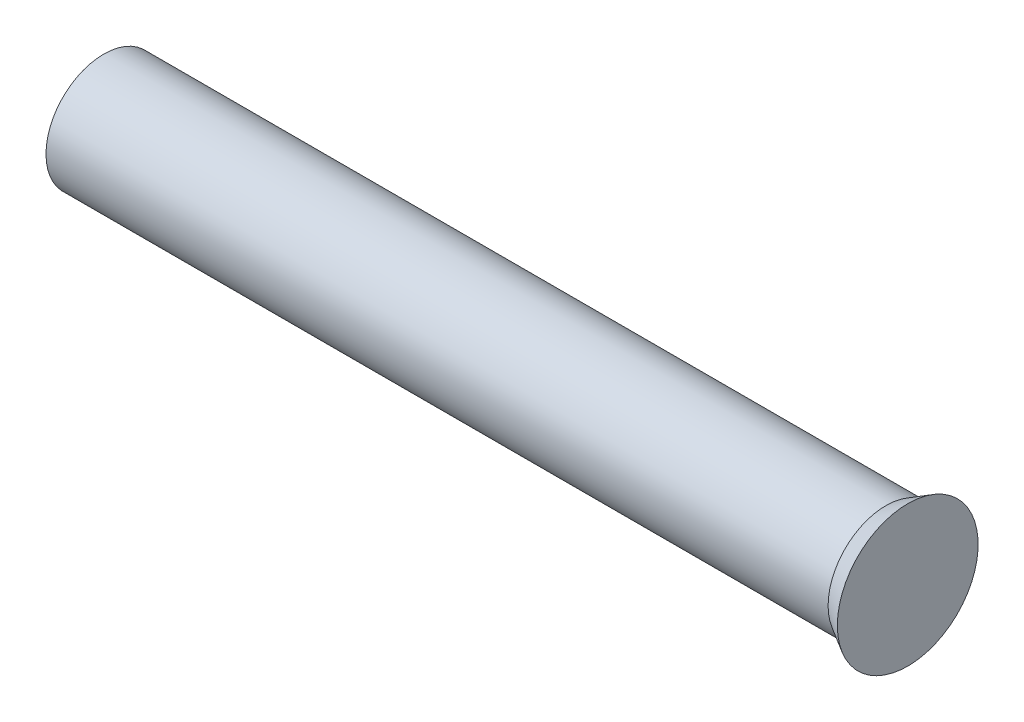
ISO-10303-21;
HEADER;
FILE_DESCRIPTION(('STEP AP214'),'2;1');
FILE_NAME('part.step','',(''),(''),'','','');
FILE_SCHEMA(('AUTOMOTIVE_DESIGN { 1 0 10303 214 1 1 1 1 }'));
ENDSEC;
DATA;
#1=APPLICATION_CONTEXT('core data for automotive mechanical design processes');
#2=APPLICATION_PROTOCOL_DEFINITION('international standard','automotive_design',2000,#1);
#3=PRODUCT_CONTEXT('',#1,'mechanical');
#4=PRODUCT('Part','Part','',(#3));
#5=PRODUCT_RELATED_PRODUCT_CATEGORY('part','',(#4));
#6=PRODUCT_DEFINITION_FORMATION('','',#4);
#7=PRODUCT_DEFINITION_CONTEXT('part definition',#1,'design');
#8=PRODUCT_DEFINITION('design','',#6,#7);
#9=PRODUCT_DEFINITION_SHAPE('','',#8);
#10=(LENGTH_UNIT() NAMED_UNIT(*) SI_UNIT(.MILLI.,.METRE.));
#11=(NAMED_UNIT(*) PLANE_ANGLE_UNIT() SI_UNIT($,.RADIAN.));
#12=(NAMED_UNIT(*) SI_UNIT($,.STERADIAN.) SOLID_ANGLE_UNIT());
#13=UNCERTAINTY_MEASURE_WITH_UNIT(LENGTH_MEASURE(1.E-05),#10,'distance_accuracy_value','');
#14=(GEOMETRIC_REPRESENTATION_CONTEXT(3) GLOBAL_UNCERTAINTY_ASSIGNED_CONTEXT((#13)) GLOBAL_UNIT_ASSIGNED_CONTEXT((#10,
#11,#12)) REPRESENTATION_CONTEXT('',''));
#15=CARTESIAN_POINT('',(0.,0.,0.));
#16=DIRECTION('',(0.,0.,1.));
#17=DIRECTION('',(1.,0.,0.));
#18=AXIS2_PLACEMENT_3D('',#15,#16,#17);
#19=CARTESIAN_POINT('',(2.794,0.,0.));
#20=DIRECTION('',(-1.,0.,0.));
#21=DIRECTION('',(0.,1.,0.));
#22=AXIS2_PLACEMENT_3D('',#19,#20,#21);
#23=SPHERICAL_SURFACE('',#22,2.794);
#24=CARTESIAN_POINT('',(0.374325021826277,0.,0.));
#25=DIRECTION('',(-1.,0.,0.));
#26=DIRECTION('',(0.,0.,1.));
#27=AXIS2_PLACEMENT_3D('',#24,#25,#26);
#28=CIRCLE('',#27,1.397);
#29=CARTESIAN_POINT('',(0.374325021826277,0.,1.397));
#30=VERTEX_POINT('',#29);
#31=EDGE_CURVE('E38',#30,#30,#28,.T.);
#32=ORIENTED_EDGE('',*,*,#31,.T.);
#33=EDGE_LOOP('',(#32));
#34=FACE_BOUND('',#33,.T.);
#35=ADVANCED_FACE('F28',(#34),#23,.T.);
#36=CARTESIAN_POINT('',(19.8119999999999,0.,0.));
#37=DIRECTION('',(-1.,0.,0.));
#38=DIRECTION('',(0.,0.,1.));
#39=AXIS2_PLACEMENT_3D('',#36,#37,#38);
#40=PLANE('',#39);
#41=CARTESIAN_POINT('',(19.8119999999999,0.,0.));
#42=DIRECTION('',(-1.,0.,0.));
#43=DIRECTION('',(0.,0.,1.));
#44=AXIS2_PLACEMENT_3D('',#41,#42,#43);
#45=CIRCLE('',#44,1.702);
#46=CARTESIAN_POINT('',(19.8119999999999,0.,1.702));
#47=VERTEX_POINT('',#46);
#48=EDGE_CURVE('E10',#47,#47,#45,.T.);
#49=ORIENTED_EDGE('',*,*,#48,.F.);
#50=EDGE_LOOP('',(#49));
#51=FACE_BOUND('',#50,.T.);
#52=ADVANCED_FACE('F53',(#51),#40,.F.);
#53=CARTESIAN_POINT('',(19.8119999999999,0.,0.));
#54=DIRECTION('',(1.,0.,0.));
#55=DIRECTION('',(0.,0.,-1.));
#56=AXIS2_PLACEMENT_3D('',#53,#54,#55);
#57=CONICAL_SURFACE('',#56,1.702,0.523598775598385);
#58=CARTESIAN_POINT('',(19.2837245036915,0.,0.));
#59=DIRECTION('',(-1.,0.,0.));
#60=DIRECTION('',(0.,0.,1.));
#61=AXIS2_PLACEMENT_3D('',#58,#59,#60);
#62=CIRCLE('',#61,1.397);
#63=CARTESIAN_POINT('',(19.2837245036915,0.,1.397));
#64=VERTEX_POINT('',#63);
#65=EDGE_CURVE('E34',#64,#64,#62,.T.);
#66=ORIENTED_EDGE('',*,*,#65,.F.);
#67=EDGE_LOOP('',(#66));
#68=FACE_BOUND('',#67,.T.);
#69=ORIENTED_EDGE('',*,*,#48,.T.);
#70=EDGE_LOOP('',(#69));
#71=FACE_BOUND('',#70,.T.);
#72=ADVANCED_FACE('F48',(#68,#71),#57,.T.);
#73=CARTESIAN_POINT('',(0.,0.,0.));
#74=DIRECTION('',(-1.,0.,0.));
#75=DIRECTION('',(0.,0.,1.));
#76=AXIS2_PLACEMENT_3D('',#73,#74,#75);
#77=CYLINDRICAL_SURFACE('',#76,1.397);
#78=ORIENTED_EDGE('',*,*,#31,.F.);
#79=EDGE_LOOP('',(#78));
#80=FACE_BOUND('',#79,.T.);
#81=ORIENTED_EDGE('',*,*,#65,.T.);
#82=EDGE_LOOP('',(#81));
#83=FACE_BOUND('',#82,.T.);
#84=ADVANCED_FACE('F46',(#80,#83),#77,.T.);
#85=CLOSED_SHELL('',(#35,#52,#72,#84));
#86=MANIFOLD_SOLID_BREP('B2',#85);
#87=ADVANCED_BREP_SHAPE_REPRESENTATION('',(#18,#86),#14);
#88=SHAPE_DEFINITION_REPRESENTATION(#9,#87);
ENDSEC;
END-ISO-10303-21;
